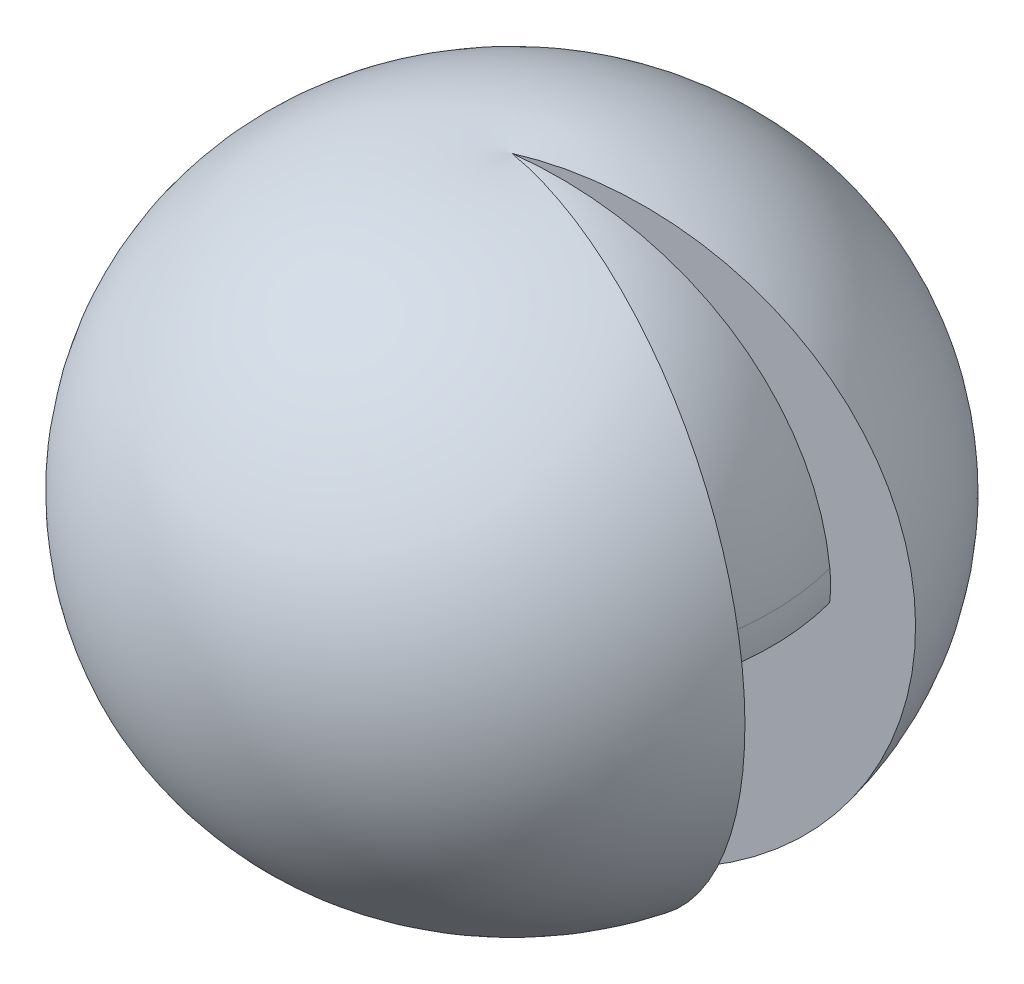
from build123d import *

# Parameters (mm, degrees)
RIVOLUZIONE3_ANGLE = 330
RIVOLUZIONE4_ANGLE = 330


with BuildPart() as part:
    # Schizzo1 → Rivoluzione3 (revolve, symmetric)
    with BuildSketch(Plane.XY) as rivoluzione3_sk:
        with BuildLine():
            Line((0, -409.34538654), (0, -675.054612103))
            ThreePointArc((0, -675.054612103), (-338.665828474, -798.316624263), (-693.590292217, -735.733143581))
            ThreePointArc((-693.590292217, -735.733143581), (-1387.350448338, 781.266331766), (0, 1707.467873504))
            Line((0, 1707.467873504), (0, 1022.833628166))
            ThreePointArc((0, 1022.833628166), (-143.489207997, 864.71201282), (-232.312055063, 670.541727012))
            ThreePointArc((-232.312055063, 670.541727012), (-397.097069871, 489.821692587), (-333.218262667, 253.742616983))
            ThreePointArc((-333.218262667, 253.742616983), (-321.893511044, -155.835659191), (0, -409.34538654))
        make_face()
    revolve(axis=Axis((0, 0, 0), (0, 1, 0)), revolution_arc=RIVOLUZIONE3_ANGLE / 2)
    revolve(rivoluzione3_sk.sketch, axis=Axis((0, 0, 0), (0, -1, 0)), revolution_arc=RIVOLUZIONE3_ANGLE / 2)

    # Schizzo2 → Rivoluzione4 (revolve, symmetric)
    with BuildSketch(Plane.XY) as rivoluzione4_sk:
        with BuildLine():
            Line((0, 1022.833628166), (0, 1707.467873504))
            ThreePointArc((0, 1707.467873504), (772.880790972, 1325.943755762), (1131.349662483, 542.10356948))
            ThreePointArc((1131.349662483, 542.10356948), (1133.983720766, 476.796958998), (1130.482291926, 411.531105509))
            ThreePointArc((1130.482291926, 411.531105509), (1125.742348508, 541.612993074), (1107.821798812, 670.541727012))
            ThreePointArc((1107.821798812, 670.541727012), (648.751598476, 1144.925001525), (0, 1022.833628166))
        make_face()
        with BuildLine():
            Line((0, -409.34538654), (0, -675.054612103))
            ThreePointArc((0, -675.054612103), (131.022840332, -555.793864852), (227.702014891, -407.324178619))
            ThreePointArc((227.702014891, -407.324178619), (113.971820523, -421.945149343), (0, -409.34538654))
        make_face()
    revolve(axis=Axis((0, 0, 0), (0, 1, 0)), revolution_arc=RIVOLUZIONE4_ANGLE / 2)
    revolve(rivoluzione4_sk.sketch, axis=Axis((0, 0, 0), (0, -1, 0)), revolution_arc=RIVOLUZIONE4_ANGLE / 2)


solid = part.part
